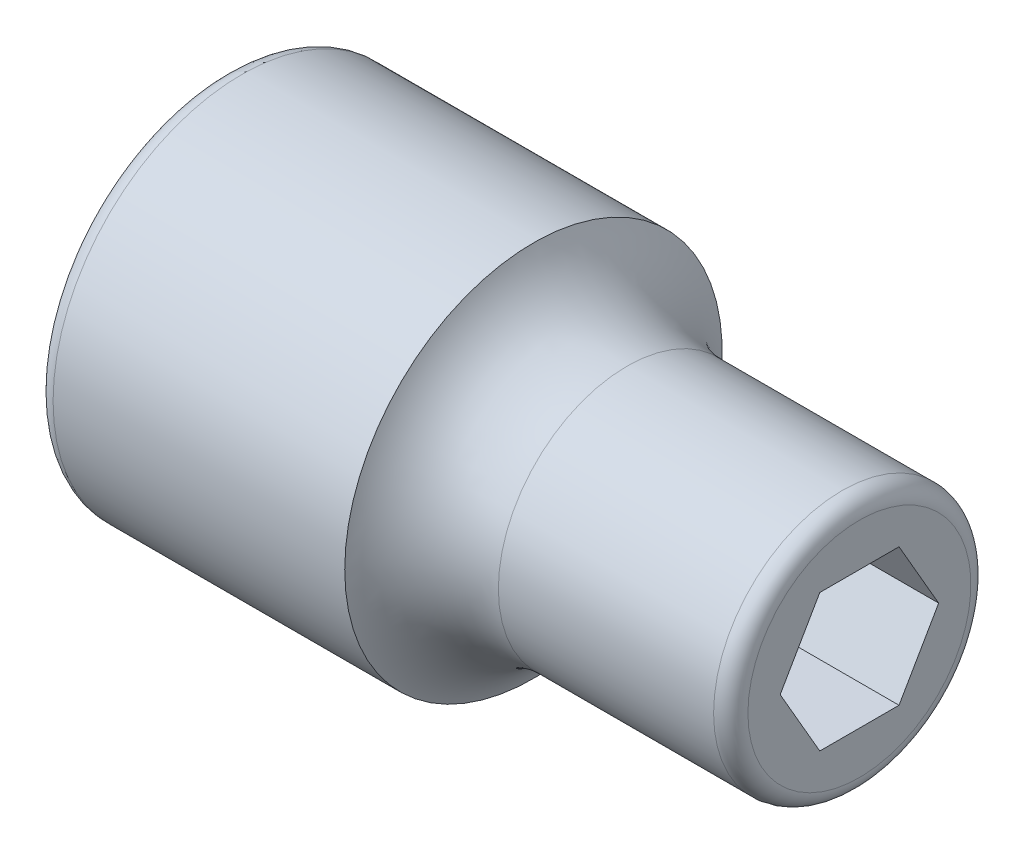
ISO-10303-21;
HEADER;
FILE_DESCRIPTION(('STEP AP214'),'2;1');
FILE_NAME('part.step','',(''),(''),'','','');
FILE_SCHEMA(('AUTOMOTIVE_DESIGN { 1 0 10303 214 1 1 1 1 }'));
ENDSEC;
DATA;
#1=APPLICATION_CONTEXT('core data for automotive mechanical design processes');
#2=APPLICATION_PROTOCOL_DEFINITION('international standard','automotive_design',2000,#1);
#3=PRODUCT_CONTEXT('',#1,'mechanical');
#4=PRODUCT('Part','Part','',(#3));
#5=PRODUCT_RELATED_PRODUCT_CATEGORY('part','',(#4));
#6=PRODUCT_DEFINITION_FORMATION('','',#4);
#7=PRODUCT_DEFINITION_CONTEXT('part definition',#1,'design');
#8=PRODUCT_DEFINITION('design','',#6,#7);
#9=PRODUCT_DEFINITION_SHAPE('','',#8);
#10=(LENGTH_UNIT() NAMED_UNIT(*) SI_UNIT(.MILLI.,.METRE.));
#11=(NAMED_UNIT(*) PLANE_ANGLE_UNIT() SI_UNIT($,.RADIAN.));
#12=(NAMED_UNIT(*) SI_UNIT($,.STERADIAN.) SOLID_ANGLE_UNIT());
#13=UNCERTAINTY_MEASURE_WITH_UNIT(LENGTH_MEASURE(1.E-05),#10,'distance_accuracy_value','');
#14=(GEOMETRIC_REPRESENTATION_CONTEXT(3) GLOBAL_UNCERTAINTY_ASSIGNED_CONTEXT((#13)) GLOBAL_UNIT_ASSIGNED_CONTEXT((#10,
#11,#12)) REPRESENTATION_CONTEXT('',''));
#15=CARTESIAN_POINT('',(0.,0.,0.));
#16=DIRECTION('',(0.,0.,1.));
#17=DIRECTION('',(1.,0.,0.));
#18=AXIS2_PLACEMENT_3D('',#15,#16,#17);
#19=CARTESIAN_POINT('',(-10.,0.,0.));
#20=DIRECTION('',(-1.,0.,0.));
#21=DIRECTION('',(0.,0.,1.));
#22=AXIS2_PLACEMENT_3D('',#19,#20,#21);
#23=CONICAL_SURFACE('',#22,6.5,1.29249666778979);
#24=CARTESIAN_POINT('',(-9.00000000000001,0.,0.));
#25=DIRECTION('',(-1.,0.,0.));
#26=DIRECTION('',(0.,0.,1.));
#27=AXIS2_PLACEMENT_3D('',#24,#25,#26);
#28=CIRCLE('',#27,3.);
#29=CARTESIAN_POINT('',(-9.00000000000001,0.,3.));
#30=VERTEX_POINT('',#29);
#31=EDGE_CURVE('E277',#30,#30,#28,.T.);
#32=ORIENTED_EDGE('',*,*,#31,.F.);
#33=EDGE_LOOP('',(#32));
#34=FACE_BOUND('',#33,.T.);
#35=CARTESIAN_POINT('',(-10.,0.,0.));
#36=DIRECTION('',(-1.,0.,0.));
#37=DIRECTION('',(0.,0.,1.));
#38=AXIS2_PLACEMENT_3D('',#35,#36,#37);
#39=CIRCLE('',#38,6.5);
#40=CARTESIAN_POINT('',(-9.99999999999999,0.,6.50000000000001));
#41=VERTEX_POINT('',#40);
#42=CARTESIAN_POINT('',(-10.,6.5,0.));
#43=VERTEX_POINT('',#42);
#44=EDGE_CURVE('E281',#41,#43,#39,.T.);
#45=ORIENTED_EDGE('',*,*,#44,.T.);
#46=CARTESIAN_POINT('',(-10.,0.,-6.5));
#47=VERTEX_POINT('',#46);
#48=EDGE_CURVE('E285',#43,#47,#39,.T.);
#49=ORIENTED_EDGE('',*,*,#48,.T.);
#50=CARTESIAN_POINT('',(-9.99999999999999,-6.5,0.));
#51=VERTEX_POINT('',#50);
#52=EDGE_CURVE('E409',#47,#51,#39,.T.);
#53=ORIENTED_EDGE('',*,*,#52,.T.);
#54=EDGE_CURVE('E280',#51,#41,#39,.T.);
#55=ORIENTED_EDGE('',*,*,#54,.T.);
#56=EDGE_LOOP('',(#45,#49,#53,#55));
#57=FACE_BOUND('',#56,.T.);
#58=ADVANCED_FACE('F30',(#34,#57),#23,.F.);
#59=CARTESIAN_POINT('',(0.,0.,0.));
#60=DIRECTION('',(-1.,0.,0.));
#61=DIRECTION('',(0.,0.,1.));
#62=AXIS2_PLACEMENT_3D('',#59,#60,#61);
#63=CYLINDRICAL_SURFACE('',#62,3.);
#64=CARTESIAN_POINT('',(0.,0.,0.));
#65=DIRECTION('',(-1.,0.,0.));
#66=DIRECTION('',(0.,0.,1.));
#67=AXIS2_PLACEMENT_3D('',#64,#65,#66);
#68=CIRCLE('',#67,3.);
#69=CARTESIAN_POINT('',(0.,0.,3.));
#70=VERTEX_POINT('',#69);
#71=EDGE_CURVE('E274',#70,#70,#68,.T.);
#72=ORIENTED_EDGE('',*,*,#71,.F.);
#73=EDGE_LOOP('',(#72));
#74=FACE_BOUND('',#73,.T.);
#75=ORIENTED_EDGE('',*,*,#31,.T.);
#76=EDGE_LOOP('',(#75));
#77=FACE_BOUND('',#76,.T.);
#78=ADVANCED_FACE('F326',(#74,#77),#63,.F.);
#79=CARTESIAN_POINT('',(0.,3.,0.));
#80=DIRECTION('',(-1.,0.,0.));
#81=DIRECTION('',(0.,0.,1.));
#82=AXIS2_PLACEMENT_3D('',#79,#80,#81);
#83=PLANE('',#82);
#84=ORIENTED_EDGE('',*,*,#71,.T.);
#85=EDGE_LOOP('',(#84));
#86=FACE_BOUND('',#85,.T.);
#87=DIRECTION('',(0.,-0.866025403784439,0.5));
#88=VECTOR('',#87,1.);
#89=CARTESIAN_POINT('',(0.,4.00000000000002,2.30940107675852));
#90=LINE('',#89,#88);
#91=CARTESIAN_POINT('',(0.,4.00000000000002,2.30940107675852));
#92=VERTEX_POINT('',#91);
#93=CARTESIAN_POINT('',(0.,0.,4.61880215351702));
#94=VERTEX_POINT('',#93);
#95=EDGE_CURVE('E182',#92,#94,#90,.T.);
#96=ORIENTED_EDGE('',*,*,#95,.T.);
#97=DIRECTION('',(0.,-0.866025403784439,-0.5));
#98=VECTOR('',#97,1.);
#99=CARTESIAN_POINT('',(0.,0.,4.61880215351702));
#100=LINE('',#99,#98);
#101=CARTESIAN_POINT('',(0.,-4.00000000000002,2.3094010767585));
#102=VERTEX_POINT('',#101);
#103=EDGE_CURVE('E185',#94,#102,#100,.T.);
#104=ORIENTED_EDGE('',*,*,#103,.T.);
#105=DIRECTION('',(0.,0.,-1.));
#106=VECTOR('',#105,1.);
#107=CARTESIAN_POINT('',(0.,-4.00000000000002,2.3094010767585));
#108=LINE('',#107,#106);
#109=CARTESIAN_POINT('',(0.,-4.,-2.30940107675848));
#110=VERTEX_POINT('',#109);
#111=EDGE_CURVE('E155',#102,#110,#108,.T.);
#112=ORIENTED_EDGE('',*,*,#111,.T.);
#113=DIRECTION('',(0.,0.866025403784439,-0.5));
#114=VECTOR('',#113,1.);
#115=CARTESIAN_POINT('',(0.,-4.,-2.30940107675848));
#116=LINE('',#115,#114);
#117=CARTESIAN_POINT('',(0.,0.,-4.61880215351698));
#118=VERTEX_POINT('',#117);
#119=EDGE_CURVE('E188',#110,#118,#116,.T.);
#120=ORIENTED_EDGE('',*,*,#119,.T.);
#121=DIRECTION('',(0.,0.866025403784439,0.5));
#122=VECTOR('',#121,1.);
#123=CARTESIAN_POINT('',(0.,0.,-4.61880215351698));
#124=LINE('',#123,#122);
#125=CARTESIAN_POINT('',(0.,4.,-2.30940107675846));
#126=VERTEX_POINT('',#125);
#127=EDGE_CURVE('E191',#118,#126,#124,.T.);
#128=ORIENTED_EDGE('',*,*,#127,.T.);
#129=DIRECTION('',(0.,0.,1.));
#130=VECTOR('',#129,1.);
#131=CARTESIAN_POINT('',(0.,4.,-2.30940107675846));
#132=LINE('',#131,#130);
#133=EDGE_CURVE('E194',#126,#92,#132,.T.);
#134=ORIENTED_EDGE('',*,*,#133,.T.);
#135=EDGE_LOOP('',(#96,#104,#112,#120,#128,#134));
#136=FACE_BOUND('',#135,.T.);
#137=ADVANCED_FACE('F331',(#86,#136),#83,.F.);
#138=CARTESIAN_POINT('',(8.99999999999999,6.50000000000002,0.));
#139=DIRECTION('',(-1.,0.,0.));
#140=DIRECTION('',(0.,0.,1.));
#141=AXIS2_PLACEMENT_3D('',#138,#139,#140);
#142=PLANE('',#141);
#143=DIRECTION('',(0.,-0.866025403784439,-0.5));
#144=VECTOR('',#143,1.);
#145=CARTESIAN_POINT('',(9.00000000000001,0.,4.61880215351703));
#146=LINE('',#145,#144);
#147=CARTESIAN_POINT('',(9.00000000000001,0.,4.61880215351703));
#148=VERTEX_POINT('',#147);
#149=CARTESIAN_POINT('',(9.00000000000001,-4.00000000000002,2.30940107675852));
#150=VERTEX_POINT('',#149);
#151=EDGE_CURVE('E163',#148,#150,#146,.T.);
#152=ORIENTED_EDGE('',*,*,#151,.F.);
#153=DIRECTION('',(0.,-0.866025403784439,0.5));
#154=VECTOR('',#153,1.);
#155=CARTESIAN_POINT('',(9.00000000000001,4.00000000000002,2.30940107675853));
#156=LINE('',#155,#154);
#157=CARTESIAN_POINT('',(9.00000000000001,4.00000000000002,2.30940107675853));
#158=VERTEX_POINT('',#157);
#159=EDGE_CURVE('E49',#158,#148,#156,.T.);
#160=ORIENTED_EDGE('',*,*,#159,.F.);
#161=DIRECTION('',(0.,0.,1.));
#162=VECTOR('',#161,1.);
#163=CARTESIAN_POINT('',(8.99999999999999,4.,-2.30940107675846));
#164=LINE('',#163,#162);
#165=CARTESIAN_POINT('',(8.99999999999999,4.,-2.30940107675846));
#166=VERTEX_POINT('',#165);
#167=EDGE_CURVE('E179',#166,#158,#164,.T.);
#168=ORIENTED_EDGE('',*,*,#167,.F.);
#169=DIRECTION('',(0.,0.866025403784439,0.5));
#170=VECTOR('',#169,1.);
#171=CARTESIAN_POINT('',(8.99999999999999,0.,-4.61880215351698));
#172=LINE('',#171,#170);
#173=CARTESIAN_POINT('',(8.99999999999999,0.,-4.61880215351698));
#174=VERTEX_POINT('',#173);
#175=EDGE_CURVE('E173',#174,#166,#172,.T.);
#176=ORIENTED_EDGE('',*,*,#175,.F.);
#177=DIRECTION('',(0.,0.866025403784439,-0.5));
#178=VECTOR('',#177,1.);
#179=CARTESIAN_POINT('',(9.00000000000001,-4.,-2.30940107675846));
#180=LINE('',#179,#178);
#181=CARTESIAN_POINT('',(9.00000000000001,-4.,-2.30940107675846));
#182=VERTEX_POINT('',#181);
#183=EDGE_CURVE('E171',#182,#174,#180,.T.);
#184=ORIENTED_EDGE('',*,*,#183,.F.);
#185=DIRECTION('',(0.,0.,-1.));
#186=VECTOR('',#185,1.);
#187=CARTESIAN_POINT('',(9.00000000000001,-4.00000000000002,2.30940107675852));
#188=LINE('',#187,#186);
#189=EDGE_CURVE('E152',#150,#182,#188,.T.);
#190=ORIENTED_EDGE('',*,*,#189,.F.);
#191=EDGE_LOOP('',(#152,#160,#168,#176,#184,#190));
#192=FACE_BOUND('',#191,.T.);
#193=CARTESIAN_POINT('',(9.00000000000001,0.,0.));
#194=DIRECTION('',(-1.,0.,0.));
#195=DIRECTION('',(0.,0.,1.));
#196=AXIS2_PLACEMENT_3D('',#193,#194,#195);
#197=CIRCLE('',#196,6.5);
#198=CARTESIAN_POINT('',(9.00000000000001,0.,6.5));
#199=VERTEX_POINT('',#198);
#200=EDGE_CURVE('E271',#199,#199,#197,.T.);
#201=ORIENTED_EDGE('',*,*,#200,.F.);
#202=EDGE_LOOP('',(#201));
#203=FACE_BOUND('',#202,.T.);
#204=ADVANCED_FACE('F167',(#192,#203),#142,.F.);
#205=CARTESIAN_POINT('',(8.00000000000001,0.,0.));
#206=DIRECTION('',(-1.,0.,0.));
#207=DIRECTION('',(0.,0.,1.));
#208=AXIS2_PLACEMENT_3D('',#205,#206,#207);
#209=TOROIDAL_SURFACE('',#208,6.5,1.);
#210=CARTESIAN_POINT('',(8.00000000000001,0.,0.));
#211=DIRECTION('',(-1.,0.,0.));
#212=DIRECTION('',(0.,0.,1.));
#213=AXIS2_PLACEMENT_3D('',#210,#211,#212);
#214=CIRCLE('',#213,7.5);
#215=CARTESIAN_POINT('',(8.00000000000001,0.,7.50000000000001));
#216=VERTEX_POINT('',#215);
#217=EDGE_CURVE('E268',#216,#216,#214,.T.);
#218=ORIENTED_EDGE('',*,*,#217,.F.);
#219=EDGE_LOOP('',(#218));
#220=FACE_BOUND('',#219,.T.);
#221=ORIENTED_EDGE('',*,*,#200,.T.);
#222=EDGE_LOOP('',(#221));
#223=FACE_BOUND('',#222,.T.);
#224=ADVANCED_FACE('F448',(#220,#223),#209,.T.);
#225=CARTESIAN_POINT('',(0.,0.,0.));
#226=DIRECTION('',(-1.,0.,0.));
#227=DIRECTION('',(0.,0.,1.));
#228=AXIS2_PLACEMENT_3D('',#225,#226,#227);
#229=CYLINDRICAL_SURFACE('',#228,7.5);
#230=CARTESIAN_POINT('',(-4.54564394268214,0.,0.));
#231=DIRECTION('',(-1.,0.,0.));
#232=DIRECTION('',(0.,0.,1.));
#233=AXIS2_PLACEMENT_3D('',#230,#231,#232);
#234=CIRCLE('',#233,7.5);
#235=CARTESIAN_POINT('',(-4.54564394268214,0.,7.50000000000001));
#236=VERTEX_POINT('',#235);
#237=EDGE_CURVE('E265',#236,#236,#234,.T.);
#238=ORIENTED_EDGE('',*,*,#237,.F.);
#239=EDGE_LOOP('',(#238));
#240=FACE_BOUND('',#239,.T.);
#241=ORIENTED_EDGE('',*,*,#217,.T.);
#242=EDGE_LOOP('',(#241));
#243=FACE_BOUND('',#242,.T.);
#244=ADVANCED_FACE('F444',(#240,#243),#229,.T.);
#245=CARTESIAN_POINT('',(-4.54564394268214,0.,0.));
#246=DIRECTION('',(-1.,0.,0.));
#247=DIRECTION('',(0.,0.,1.));
#248=AXIS2_PLACEMENT_3D('',#245,#246,#247);
#249=TOROIDAL_SURFACE('',#248,13.5,6.);
#250=CARTESIAN_POINT('',(-9.99999999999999,0.,0.));
#251=DIRECTION('',(-1.,0.,0.));
#252=DIRECTION('',(0.,0.,1.));
#253=AXIS2_PLACEMENT_3D('',#250,#251,#252);
#254=CIRCLE('',#253,11.);
#255=CARTESIAN_POINT('',(-9.99999999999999,0.,11.));
#256=VERTEX_POINT('',#255);
#257=EDGE_CURVE('E262',#256,#256,#254,.T.);
#258=ORIENTED_EDGE('',*,*,#257,.F.);
#259=EDGE_LOOP('',(#258));
#260=FACE_BOUND('',#259,.T.);
#261=ORIENTED_EDGE('',*,*,#237,.T.);
#262=EDGE_LOOP('',(#261));
#263=FACE_BOUND('',#262,.T.);
#264=ADVANCED_FACE('F440',(#260,#263),#249,.F.);
#265=CARTESIAN_POINT('',(0.,0.,0.));
#266=DIRECTION('',(-1.,0.,0.));
#267=DIRECTION('',(0.,0.,1.));
#268=AXIS2_PLACEMENT_3D('',#265,#266,#267);
#269=CYLINDRICAL_SURFACE('',#268,11.);
#270=CARTESIAN_POINT('',(-27.,0.,0.));
#271=DIRECTION('',(-1.,0.,0.));
#272=DIRECTION('',(0.,0.,1.));
#273=AXIS2_PLACEMENT_3D('',#270,#271,#272);
#274=CIRCLE('',#273,11.);
#275=CARTESIAN_POINT('',(-27.,0.,11.));
#276=VERTEX_POINT('',#275);
#277=EDGE_CURVE('E259',#276,#276,#274,.T.);
#278=ORIENTED_EDGE('',*,*,#277,.F.);
#279=EDGE_LOOP('',(#278));
#280=FACE_BOUND('',#279,.T.);
#281=ORIENTED_EDGE('',*,*,#257,.T.);
#282=EDGE_LOOP('',(#281));
#283=FACE_BOUND('',#282,.T.);
#284=ADVANCED_FACE('F432',(#280,#283),#269,.T.);
#285=CARTESIAN_POINT('',(-27.,0.,0.));
#286=DIRECTION('',(-1.,0.,0.));
#287=DIRECTION('',(0.,0.,1.));
#288=AXIS2_PLACEMENT_3D('',#285,#286,#287);
#289=TOROIDAL_SURFACE('',#288,10.,1.);
#290=CARTESIAN_POINT('',(-28.,0.,0.));
#291=DIRECTION('',(-1.,0.,0.));
#292=DIRECTION('',(0.,0.,1.));
#293=AXIS2_PLACEMENT_3D('',#290,#291,#292);
#294=CIRCLE('',#293,10.);
#295=CARTESIAN_POINT('',(-28.,0.,10.));
#296=VERTEX_POINT('',#295);
#297=EDGE_CURVE('E256',#296,#296,#294,.T.);
#298=ORIENTED_EDGE('',*,*,#297,.F.);
#299=EDGE_LOOP('',(#298));
#300=FACE_BOUND('',#299,.T.);
#301=ORIENTED_EDGE('',*,*,#277,.T.);
#302=EDGE_LOOP('',(#301));
#303=FACE_BOUND('',#302,.T.);
#304=ADVANCED_FACE('F427',(#300,#303),#289,.T.);
#305=CARTESIAN_POINT('',(-28.,8.99999999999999,0.));
#306=DIRECTION('',(1.,0.,0.));
#307=DIRECTION('',(0.,0.,-1.));
#308=AXIS2_PLACEMENT_3D('',#305,#306,#307);
#309=PLANE('',#308);
#310=CARTESIAN_POINT('',(-28.,0.,0.));
#311=DIRECTION('',(-1.,0.,0.));
#312=DIRECTION('',(0.,0.,1.));
#313=AXIS2_PLACEMENT_3D('',#310,#311,#312);
#314=CIRCLE('',#313,9.);
#315=CARTESIAN_POINT('',(-28.,0.,9.00000000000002));
#316=VERTEX_POINT('',#315);
#317=EDGE_CURVE('E234',#316,#316,#314,.T.);
#318=ORIENTED_EDGE('',*,*,#317,.F.);
#319=EDGE_LOOP('',(#318));
#320=FACE_BOUND('',#319,.T.);
#321=ORIENTED_EDGE('',*,*,#297,.T.);
#322=EDGE_LOOP('',(#321));
#323=FACE_BOUND('',#322,.T.);
#324=ADVANCED_FACE('F423',(#320,#323),#309,.F.);
#325=CARTESIAN_POINT('',(-28.,0.,0.));
#326=DIRECTION('',(-1.,0.,0.));
#327=DIRECTION('',(0.,0.,1.));
#328=AXIS2_PLACEMENT_3D('',#325,#326,#327);
#329=CONICAL_SURFACE('',#328,9.,1.0471975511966);
#330=CARTESIAN_POINT('',(-30.5576145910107,6.50000000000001,-11.7521363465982));
#331=CARTESIAN_POINT('',(-30.4054892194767,6.5,-11.4509730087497));
#332=CARTESIAN_POINT('',(-30.254408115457,6.5,-11.1492757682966));
#333=CARTESIAN_POINT('',(-29.954900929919,6.5,-10.5445340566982));
#334=CARTESIAN_POINT('',(-29.8064750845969,6.5,-10.2414894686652));
#335=CARTESIAN_POINT('',(-29.5124023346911,6.5,-9.63285472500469));
#336=CARTESIAN_POINT('',(-29.3667658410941,6.5,-9.32725952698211));
#337=CARTESIAN_POINT('',(-29.0795802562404,6.5,-8.71416153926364));
#338=CARTESIAN_POINT('',(-28.938031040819,6.5,-8.40665880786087));
#339=CARTESIAN_POINT('',(-28.6532723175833,6.5,-7.77421539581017));
#340=CARTESIAN_POINT('',(-28.510320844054,6.5,-7.44915808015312));
#341=CARTESIAN_POINT('',(-28.2317222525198,6.5,-6.79588008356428));
#342=CARTESIAN_POINT('',(-28.0960757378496,6.5,-6.46765914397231));
#343=CARTESIAN_POINT('',(-27.8345137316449,6.5,-5.80778142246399));
#344=CARTESIAN_POINT('',(-27.7085870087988,6.5,-5.47612912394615));
#345=CARTESIAN_POINT('',(-27.4693743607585,6.5,-4.80832449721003));
#346=CARTESIAN_POINT('',(-27.356085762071,6.5,-4.4721731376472));
#347=CARTESIAN_POINT('',(-27.147157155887,6.5,-3.7977916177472));
#348=CARTESIAN_POINT('',(-27.0513628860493,6.5,-3.45960982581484));
#349=CARTESIAN_POINT('',(-26.8810976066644,6.5,-2.77778978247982));
#350=CARTESIAN_POINT('',(-26.8066248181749,6.5,-2.4341519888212));
#351=CARTESIAN_POINT('',(-26.7154889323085,6.5,-1.91809179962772));
#352=CARTESIAN_POINT('',(-26.6886838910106,6.5,-1.74743857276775));
#353=CARTESIAN_POINT('',(-26.6421154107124,6.5,-1.40518144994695));
#354=CARTESIAN_POINT('',(-26.6223511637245,6.5,-1.23357766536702));
#355=CARTESIAN_POINT('',(-26.5903457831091,6.5,-0.889664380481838));
#356=CARTESIAN_POINT('',(-26.5781046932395,6.5,-0.717354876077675));
#357=CARTESIAN_POINT('',(-26.5614672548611,6.5,-0.372371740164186));
#358=CARTESIAN_POINT('',(-26.5570701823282,6.5,-0.199698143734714));
#359=CARTESIAN_POINT('',(-26.5561881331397,6.5,0.168707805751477));
#360=CARTESIAN_POINT('',(-26.5608366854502,6.5,0.364443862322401));
#361=CARTESIAN_POINT('',(-26.5802084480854,6.5,0.755415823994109));
#362=CARTESIAN_POINT('',(-26.5949320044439,6.5,0.950651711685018));
#363=CARTESIAN_POINT('',(-26.6339613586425,6.5,1.34019669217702));
#364=CARTESIAN_POINT('',(-26.6582692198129,6.5,1.53450557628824));
#365=CARTESIAN_POINT('',(-26.715722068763,6.5,1.92180270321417));
#366=CARTESIAN_POINT('',(-26.7488671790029,6.5,2.11479092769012));
#367=CARTESIAN_POINT('',(-26.8239967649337,6.5,2.50384101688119));
#368=CARTESIAN_POINT('',(-26.8661745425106,6.5,2.69986527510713));
#369=CARTESIAN_POINT('',(-26.9578591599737,6.5,3.09018285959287));
#370=CARTESIAN_POINT('',(-27.0073661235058,6.5,3.28447615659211));
#371=CARTESIAN_POINT('',(-27.1127397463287,6.5,3.67134216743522));
#372=CARTESIAN_POINT('',(-27.1686070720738,6.5,3.86391469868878));
#373=CARTESIAN_POINT('',(-27.285799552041,6.5,4.24736827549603));
#374=CARTESIAN_POINT('',(-27.3471243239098,6.5,4.43824943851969));
#375=CARTESIAN_POINT('',(-27.4835833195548,6.5,4.84573547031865));
#376=CARTESIAN_POINT('',(-27.5594361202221,6.5,5.06209899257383));
#377=CARTESIAN_POINT('',(-27.7162410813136,6.5,5.49297706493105));
#378=CARTESIAN_POINT('',(-27.7971935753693,6.5,5.70749149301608));
#379=CARTESIAN_POINT('',(-27.9633781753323,6.5,6.13491998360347));
#380=CARTESIAN_POINT('',(-28.0486114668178,6.5,6.34783358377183));
#381=CARTESIAN_POINT('',(-28.2226540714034,6.5,6.7721969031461));
#382=CARTESIAN_POINT('',(-28.3114634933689,6.5,6.98364657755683));
#383=CARTESIAN_POINT('',(-28.5825817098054,6.5,7.61654060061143));
#384=CARTESIAN_POINT('',(-28.7693932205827,6.5,8.03605612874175));
#385=CARTESIAN_POINT('',(-29.151582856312,6.5,8.87106252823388));
#386=CARTESIAN_POINT('',(-29.3469597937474,6.5,9.28655394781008));
#387=CARTESIAN_POINT('',(-29.7448752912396,6.5,10.1161801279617));
#388=CARTESIAN_POINT('',(-29.9474399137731,6.5,10.5303023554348));
#389=CARTESIAN_POINT('',(-30.3573898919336,6.5,11.3561615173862));
#390=CARTESIAN_POINT('',(-30.5647753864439,6.5,11.7678983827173));
#391=CARTESIAN_POINT('',(-30.9831095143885,6.5,12.5892144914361));
#392=CARTESIAN_POINT('',(-31.1940557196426,6.5,12.9987949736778));
#393=CARTESIAN_POINT('',(-31.6188428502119,6.5,13.8164446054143));
#394=CARTESIAN_POINT('',(-31.8326837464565,6.5,14.2245137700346));
#395=CARTESIAN_POINT('',(-32.4167228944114,6.5,15.3314433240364));
#396=CARTESIAN_POINT('',(-32.7891517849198,6.5,16.0291261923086));
#397=CARTESIAN_POINT('',(-33.5387742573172,6.5,17.4220905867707));
#398=CARTESIAN_POINT('',(-33.9159687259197,6.5,18.1173716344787));
#399=CARTESIAN_POINT('',(-34.6708699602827,6.5,19.5007505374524));
#400=CARTESIAN_POINT('',(-35.0485506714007,6.5,20.1888626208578));
#401=CARTESIAN_POINT('',(-35.6169204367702,6.5,21.2199167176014));
#402=CARTESIAN_POINT('',(-35.8066652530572,6.5,21.563379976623));
#403=CARTESIAN_POINT('',(-36.1867090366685,6.5,22.2499991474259));
#404=CARTESIAN_POINT('',(-36.3770080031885,6.49999999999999,22.5931550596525));
#405=CARTESIAN_POINT('',(-36.5675468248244,6.49999999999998,22.9361777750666));
#406=B_SPLINE_CURVE_WITH_KNOTS('',3,(#330,#331,#332,#333,#334,#335,#336,#337,#338,#339,#340,
#341,#342,#343,#344,#345,#346,#347,#348,#349,#350,#351,#352,#353,#354,#355,#356,#357,#358,#359,
#360,#361,#362,#363,#364,#365,#366,#367,#368,#369,#370,#371,#372,#373,#374,#375,#376,#377,#378,
#379,#380,#381,#382,#383,#384,#385,#386,#387,#388,#389,#390,#391,#392,#393,#394,#395,#396,#397,
#398,#399,#400,#401,#402,#403,#404,#405),.UNSPECIFIED.,.F.,.F.,(4,2,2,2,2,2,2,2,2,2,2,2,2,2,2,2,
2,2,2,2,2,2,2,2,2,2,2,2,2,2,2,2,2,2,2,2,2,4),(0.,1.01221862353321,2.02452684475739,
3.04007404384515,4.05559035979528,5.12082778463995,6.18615305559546,7.25022830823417,
8.31407803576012,9.36803883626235,10.4219116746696,10.9400261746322,11.4580811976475,
11.9761392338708,12.4941494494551,13.081251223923,13.6683731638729,14.2556215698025,
14.8428781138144,15.4442489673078,16.0456299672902,16.647074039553,17.2484760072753,
17.9362210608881,18.6240111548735,19.3119927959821,19.9999953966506,21.3775283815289,
22.7548709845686,24.1378567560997,25.5208824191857,26.9030002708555,28.2851042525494,
30.6576645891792,33.0306730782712,35.3855049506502,36.5626753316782,37.739844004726),.UNSPECIFIED.);
#407=CARTESIAN_POINT('',(-27.7198079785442,6.5,-5.49999999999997));
#408=VERTEX_POINT('',#407);
#409=CARTESIAN_POINT('',(-27.7198079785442,6.49999999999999,5.50000000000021));
#410=VERTEX_POINT('',#409);
#411=EDGE_CURVE('E284',#408,#410,#406,.T.);
#412=ORIENTED_EDGE('',*,*,#411,.T.);
#413=CARTESIAN_POINT('',(-27.7197333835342,6.49999998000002,5.49980000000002));
#414=CARTESIAN_POINT('',(-27.7293540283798,6.50000453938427,5.52559205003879));
#415=CARTESIAN_POINT('',(-27.7386202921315,6.49901163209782,5.55150730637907));
#416=CARTESIAN_POINT('',(-27.7563875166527,6.4949761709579,5.60345282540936));
#417=CARTESIAN_POINT('',(-27.7648881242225,6.49193267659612,5.6294831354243));
#418=CARTESIAN_POINT('',(-27.7891719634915,6.47963121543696,5.70760426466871));
#419=CARTESIAN_POINT('',(-27.8037032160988,6.46720186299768,5.75963429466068));
#420=CARTESIAN_POINT('',(-27.8289071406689,6.43373424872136,5.86201024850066));
#421=CARTESIAN_POINT('',(-27.8395680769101,6.41267020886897,5.91235063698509));
#422=CARTESIAN_POINT('',(-27.856523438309,6.36224712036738,6.0094240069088));
#423=CARTESIAN_POINT('',(-27.8628245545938,6.33290088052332,6.05616241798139));
#424=CARTESIAN_POINT('',(-27.8705536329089,6.26868988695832,6.14171819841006));
#425=CARTESIAN_POINT('',(-27.8722542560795,6.23426840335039,6.18084420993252));
#426=CARTESIAN_POINT('',(-27.8715013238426,6.159785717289,6.25324543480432));
#427=CARTESIAN_POINT('',(-27.8690484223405,6.11972540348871,6.28652156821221));
#428=CARTESIAN_POINT('',(-27.8602479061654,6.03670997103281,6.34524445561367));
#429=CARTESIAN_POINT('',(-27.8540381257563,5.99390316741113,6.37092246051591));
#430=CARTESIAN_POINT('',(-27.8380723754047,5.90545961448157,6.4154556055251));
#431=CARTESIAN_POINT('',(-27.8283126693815,5.8598199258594,6.43430351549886));
#432=CARTESIAN_POINT('',(-27.8043232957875,5.76191763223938,6.4666094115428));
#433=CARTESIAN_POINT('',(-27.7897222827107,5.70947548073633,6.47925566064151));
#434=CARTESIAN_POINT('',(-27.7652799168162,5.63069503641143,6.49178075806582));
#435=CARTESIAN_POINT('',(-27.7567107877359,5.60442017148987,6.49488176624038));
#436=CARTESIAN_POINT('',(-27.7387923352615,5.55198874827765,6.49899291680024));
#437=CARTESIAN_POINT('',(-27.7294434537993,5.52583213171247,6.50000423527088));
#438=CARTESIAN_POINT('',(-27.7197333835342,5.49980000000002,6.49999998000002));
#439=B_SPLINE_CURVE_WITH_KNOTS('',3,(#413,#414,#415,#416,#417,#418,#419,#420,#421,#422,#423,
#424,#425,#426,#427,#428,#429,#430,#431,#432,#433,#434,#435,#436,#437,#438),.UNSPECIFIED.,.F.,
.F.,(4,2,2,2,2,2,2,2,2,2,2,2,4),(0.,0.0825432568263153,0.165124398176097,0.330574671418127,
0.49652251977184,0.662215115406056,0.817847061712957,0.973454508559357,1.12367255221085,
1.27404915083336,1.44082159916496,1.52417731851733,1.60748611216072),.UNSPECIFIED.);
#440=CARTESIAN_POINT('',(-27.7198079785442,5.49999999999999,6.50000000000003));
#441=VERTEX_POINT('',#440);
#442=EDGE_CURVE('E11',#410,#441,#439,.T.);
#443=ORIENTED_EDGE('',*,*,#442,.T.);
#444=CARTESIAN_POINT('',(-30.5576153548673,-11.7521378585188,6.50000000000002));
#445=CARTESIAN_POINT('',(-30.405489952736,-11.4509744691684,6.50000000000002));
#446=CARTESIAN_POINT('',(-30.2544088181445,-11.1492771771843,6.50000000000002));
#447=CARTESIAN_POINT('',(-29.9549015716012,-10.5445353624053,6.50000000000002));
#448=CARTESIAN_POINT('',(-29.8064756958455,-10.2414907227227,6.50000000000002));
#449=CARTESIAN_POINT('',(-29.5124028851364,-9.63285587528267,6.50000000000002));
#450=CARTESIAN_POINT('',(-29.3667663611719,-9.32726062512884,6.50000000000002));
#451=CARTESIAN_POINT('',(-29.079580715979,-8.71416253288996,6.50000000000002));
#452=CARTESIAN_POINT('',(-28.938031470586,-8.40665974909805,6.50000000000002));
#453=CARTESIAN_POINT('',(-28.6532726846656,-7.77421622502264,6.50000000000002));
#454=CARTESIAN_POINT('',(-28.5103211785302,-7.44915884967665,6.50000000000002));
#455=CARTESIAN_POINT('',(-28.2317225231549,-6.79588073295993,6.50000000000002));
#456=CARTESIAN_POINT('',(-28.0960759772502,-6.46765973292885,6.50000000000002));
#457=CARTESIAN_POINT('',(-27.8345139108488,-5.80778188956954,6.50000000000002));
#458=CARTESIAN_POINT('',(-27.708587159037,-5.47612952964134,6.50000000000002));
#459=CARTESIAN_POINT('',(-27.4693744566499,-4.80832477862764,6.50000000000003));
#460=CARTESIAN_POINT('',(-27.3560858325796,-4.4721733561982,6.50000000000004));
#461=CARTESIAN_POINT('',(-27.1471571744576,-3.79779168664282,6.50000000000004));
#462=CARTESIAN_POINT('',(-27.0513628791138,-3.45960980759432,6.50000000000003));
#463=CARTESIAN_POINT('',(-26.8810975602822,-2.77778958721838,6.50000000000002));
#464=CARTESIAN_POINT('',(-26.8066247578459,-2.43415170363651,6.50000000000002));
#465=CARTESIAN_POINT('',(-26.7154888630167,-1.91809137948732,6.50000000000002));
#466=CARTESIAN_POINT('',(-26.6886838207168,-1.74743810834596,6.50000000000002));
#467=CARTESIAN_POINT('',(-26.6421153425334,-1.40518089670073,6.50000000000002));
#468=CARTESIAN_POINT('',(-26.6223510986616,-1.23357706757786,6.50000000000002));
#469=CARTESIAN_POINT('',(-26.5903457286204,-0.889663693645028,6.50000000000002));
#470=CARTESIAN_POINT('',(-26.5781046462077,-0.717354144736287,6.50000000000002));
#471=CARTESIAN_POINT('',(-26.5614672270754,-0.372370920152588,6.50000000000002));
#472=CARTESIAN_POINT('',(-26.5570701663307,-0.199697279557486,6.50000000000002));
#473=CARTESIAN_POINT('',(-26.5561881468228,0.168708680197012,6.50000000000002));
#474=CARTESIAN_POINT('',(-26.5608367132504,0.364444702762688,6.50000000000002));
#475=CARTESIAN_POINT('',(-26.5802085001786,0.755416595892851,6.50000000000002));
#476=CARTESIAN_POINT('',(-26.5949320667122,0.950652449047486,6.50000000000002));
#477=CARTESIAN_POINT('',(-26.6339614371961,1.34019736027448,6.50000000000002));
#478=CARTESIAN_POINT('',(-26.6582693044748,1.53450620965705,6.50000000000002));
#479=CARTESIAN_POINT('',(-26.7157221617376,1.92180326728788,6.50000000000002));
#480=CARTESIAN_POINT('',(-26.7488672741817,2.11479145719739,6.50000000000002));
#481=CARTESIAN_POINT('',(-26.8239968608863,2.50384147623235,6.50000000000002));
#482=CARTESIAN_POINT('',(-26.8661746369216,2.69986569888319,6.50000000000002));
#483=CARTESIAN_POINT('',(-26.9578592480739,3.09018321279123,6.50000000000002));
#484=CARTESIAN_POINT('',(-27.0073662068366,3.28447647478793,6.50000000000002));
#485=CARTESIAN_POINT('',(-27.112739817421,3.67134241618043,6.50000000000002));
#486=CARTESIAN_POINT('',(-27.1686071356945,3.86391491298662,6.50000000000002));
#487=CARTESIAN_POINT('',(-27.2857995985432,4.24736842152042,6.50000000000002));
#488=CARTESIAN_POINT('',(-27.3471243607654,4.43824955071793,6.50000000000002));
#489=CARTESIAN_POINT('',(-27.483583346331,4.84573554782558,6.50000000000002));
#490=CARTESIAN_POINT('',(-27.5594361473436,5.06209906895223,6.50000000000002));
#491=CARTESIAN_POINT('',(-27.7162411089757,5.49297713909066,6.50000000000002));
#492=CARTESIAN_POINT('',(-27.7971936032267,5.70749156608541,6.50000000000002));
#493=CARTESIAN_POINT('',(-27.9633782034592,6.13492005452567,6.50000000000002));
#494=CARTESIAN_POINT('',(-28.0486114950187,6.34783365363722,6.50000000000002));
#495=CARTESIAN_POINT('',(-28.2226540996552,6.77219697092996,6.50000000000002));
#496=CARTESIAN_POINT('',(-28.3114635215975,6.98364664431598,6.50000000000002));
#497=CARTESIAN_POINT('',(-28.58258173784,7.61654066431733,6.50000000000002));
#498=CARTESIAN_POINT('',(-28.7693932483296,8.03605619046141,6.50000000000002));
#499=CARTESIAN_POINT('',(-29.1515828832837,8.87106258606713,6.50000000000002));
#500=CARTESIAN_POINT('',(-29.3469598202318,9.28655400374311,6.50000000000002));
#501=CARTESIAN_POINT('',(-29.7448753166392,10.1161801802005,6.50000000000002));
#502=CARTESIAN_POINT('',(-29.9474399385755,10.5303024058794,6.50000000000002));
#503=CARTESIAN_POINT('',(-30.357389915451,11.3561615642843,6.50000000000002));
#504=CARTESIAN_POINT('',(-30.5647754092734,11.7678984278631,6.50000000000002));
#505=CARTESIAN_POINT('',(-30.983109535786,12.5892145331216,6.50000000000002));
#506=CARTESIAN_POINT('',(-31.1940557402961,12.9987950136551,6.50000000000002));
#507=CARTESIAN_POINT('',(-31.6188428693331,13.8164446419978,6.50000000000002));
#508=CARTESIAN_POINT('',(-31.8326837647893,14.2245138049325,6.50000000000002));
#509=CARTESIAN_POINT('',(-32.4167229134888,15.3314433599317,6.50000000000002));
#510=CARTESIAN_POINT('',(-32.7891518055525,16.0291262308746,6.50000000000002));
#511=CARTESIAN_POINT('',(-33.5387742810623,17.4220906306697,6.50000000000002));
#512=CARTESIAN_POINT('',(-33.9159687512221,18.1173716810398,6.50000000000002));
#513=CARTESIAN_POINT('',(-34.6708699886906,19.5007505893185,6.50000000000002));
#514=CARTESIAN_POINT('',(-35.0485507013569,20.1888626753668,6.50000000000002));
#515=CARTESIAN_POINT('',(-35.6169204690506,21.2199167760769,6.50000000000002));
#516=CARTESIAN_POINT('',(-35.8066652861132,21.5633800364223,6.50000000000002));
#517=CARTESIAN_POINT('',(-36.1867090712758,22.249999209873,6.50000000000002));
#518=CARTESIAN_POINT('',(-36.3770080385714,22.5931551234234,6.50000000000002));
#519=CARTESIAN_POINT('',(-36.5675468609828,22.9361778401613,6.50000000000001));
#520=B_SPLINE_CURVE_WITH_KNOTS('',3,(#444,#445,#446,#447,#448,#449,#450,#451,#452,#453,#454,
#455,#456,#457,#458,#459,#460,#461,#462,#463,#464,#465,#466,#467,#468,#469,#470,#471,#472,#473,
#474,#475,#476,#477,#478,#479,#480,#481,#482,#483,#484,#485,#486,#487,#488,#489,#490,#491,#492,
#493,#494,#495,#496,#497,#498,#499,#500,#501,#502,#503,#504,#505,#506,#507,#508,#509,#510,#511,
#512,#513,#514,#515,#516,#517,#518,#519),.UNSPECIFIED.,.F.,.F.,(4,2,2,2,2,2,2,2,2,2,2,2,2,2,2,2,
2,2,2,2,2,2,2,2,2,2,2,2,2,2,2,2,2,2,2,2,2,4),(0.,1.01221880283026,2.02452720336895,
3.04007458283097,4.05559107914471,5.1208287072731,6.18615418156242,7.25022963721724,
8.31407956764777,9.36804064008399,10.4219137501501,10.9400283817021,11.4580835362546,
11.9761417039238,12.4941520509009,13.0812537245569,13.6683755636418,14.2556238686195,
14.8428803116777,15.4442510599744,16.0456319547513,16.6470759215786,17.2484777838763,
17.9362228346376,18.6240129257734,19.3119945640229,19.9999971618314,21.377530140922,
22.7548727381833,24.1378585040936,25.520884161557,26.9030020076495,28.2851059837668,
30.657666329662,33.0306748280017,35.3855067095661,36.5626770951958,37.7398457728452),.UNSPECIFIED.);
#521=CARTESIAN_POINT('',(-27.7198079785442,-5.49999999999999,6.50000000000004));
#522=VERTEX_POINT('',#521);
#523=EDGE_CURVE('E42',#441,#522,#520,.F.);
#524=ORIENTED_EDGE('',*,*,#523,.T.);
#525=CARTESIAN_POINT('',(-27.7197333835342,-5.49979999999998,6.49999998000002));
#526=CARTESIAN_POINT('',(-27.7293540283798,-5.52559205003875,6.50000453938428));
#527=CARTESIAN_POINT('',(-27.7386202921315,-5.55150730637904,6.49901163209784));
#528=CARTESIAN_POINT('',(-27.7563875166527,-5.60345282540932,6.49497617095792));
#529=CARTESIAN_POINT('',(-27.7648881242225,-5.62948313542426,6.49193267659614));
#530=CARTESIAN_POINT('',(-27.7891719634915,-5.70760426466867,6.47963121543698));
#531=CARTESIAN_POINT('',(-27.8037032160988,-5.75963429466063,6.4672018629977));
#532=CARTESIAN_POINT('',(-27.8289071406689,-5.86201024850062,6.43373424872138));
#533=CARTESIAN_POINT('',(-27.8395680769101,-5.91235063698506,6.41267020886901));
#534=CARTESIAN_POINT('',(-27.856523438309,-6.00942400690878,6.36224712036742));
#535=CARTESIAN_POINT('',(-27.8628245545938,-6.05616241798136,6.33290088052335));
#536=CARTESIAN_POINT('',(-27.8705536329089,-6.14171819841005,6.26868988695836));
#537=CARTESIAN_POINT('',(-27.8722542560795,-6.18084420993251,6.23426840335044));
#538=CARTESIAN_POINT('',(-27.8715013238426,-6.2532454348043,6.15978571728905));
#539=CARTESIAN_POINT('',(-27.8690484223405,-6.28652156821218,6.11972540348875));
#540=CARTESIAN_POINT('',(-27.8602479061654,-6.34524445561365,6.03670997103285));
#541=CARTESIAN_POINT('',(-27.8540381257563,-6.37092246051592,5.99390316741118));
#542=CARTESIAN_POINT('',(-27.8380723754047,-6.4154556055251,5.90545961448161));
#543=CARTESIAN_POINT('',(-27.8283126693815,-6.43430351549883,5.85981992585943));
#544=CARTESIAN_POINT('',(-27.8043232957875,-6.46660941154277,5.76191763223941));
#545=CARTESIAN_POINT('',(-27.7897222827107,-6.47925566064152,5.70947548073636));
#546=CARTESIAN_POINT('',(-27.7652799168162,-6.49178075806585,5.63069503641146));
#547=CARTESIAN_POINT('',(-27.7567107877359,-6.49488176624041,5.6044201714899));
#548=CARTESIAN_POINT('',(-27.7387923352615,-6.49899291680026,5.55198874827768));
#549=CARTESIAN_POINT('',(-27.7294434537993,-6.50000423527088,5.52583213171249));
#550=CARTESIAN_POINT('',(-27.7197333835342,-6.49999998,5.49980000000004));
#551=B_SPLINE_CURVE_WITH_KNOTS('',3,(#525,#526,#527,#528,#529,#530,#531,#532,#533,#534,#535,
#536,#537,#538,#539,#540,#541,#542,#543,#544,#545,#546,#547,#548,#549,#550),.UNSPECIFIED.,.F.,
.F.,(4,2,2,2,2,2,2,2,2,2,2,2,4),(0.,0.0825432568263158,0.165124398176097,0.330574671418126,
0.496522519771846,0.66221511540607,0.81784706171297,0.973454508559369,1.12367255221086,
1.27404915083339,1.440821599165,1.52417731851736,1.60748611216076),.UNSPECIFIED.);
#552=CARTESIAN_POINT('',(-27.7198079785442,-6.5,5.50000000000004));
#553=VERTEX_POINT('',#552);
#554=EDGE_CURVE('E349',#522,#553,#551,.T.);
#555=ORIENTED_EDGE('',*,*,#554,.T.);
#556=CARTESIAN_POINT('',(-30.5576145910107,-6.5,-11.7521363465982));
#557=CARTESIAN_POINT('',(-30.4054892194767,-6.5,-11.4509730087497));
#558=CARTESIAN_POINT('',(-30.254408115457,-6.50000000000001,-11.1492757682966));
#559=CARTESIAN_POINT('',(-29.954900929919,-6.50000000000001,-10.5445340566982));
#560=CARTESIAN_POINT('',(-29.8064750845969,-6.50000000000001,-10.2414894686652));
#561=CARTESIAN_POINT('',(-29.5124023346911,-6.50000000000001,-9.63285472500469));
#562=CARTESIAN_POINT('',(-29.3667658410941,-6.50000000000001,-9.3272595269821));
#563=CARTESIAN_POINT('',(-29.0795802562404,-6.50000000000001,-8.71416153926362));
#564=CARTESIAN_POINT('',(-28.938031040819,-6.50000000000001,-8.40665880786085));
#565=CARTESIAN_POINT('',(-28.6532723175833,-6.50000000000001,-7.77421539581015));
#566=CARTESIAN_POINT('',(-28.510320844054,-6.50000000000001,-7.44915808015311));
#567=CARTESIAN_POINT('',(-28.2317222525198,-6.50000000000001,-6.79588008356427));
#568=CARTESIAN_POINT('',(-28.0960757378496,-6.50000000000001,-6.46765914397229));
#569=CARTESIAN_POINT('',(-27.8345137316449,-6.50000000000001,-5.80778142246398));
#570=CARTESIAN_POINT('',(-27.7085870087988,-6.50000000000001,-5.47612912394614));
#571=CARTESIAN_POINT('',(-27.4693743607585,-6.5,-4.80832449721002));
#572=CARTESIAN_POINT('',(-27.356085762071,-6.5,-4.47217313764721));
#573=CARTESIAN_POINT('',(-27.147157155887,-6.5,-3.79779161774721));
#574=CARTESIAN_POINT('',(-27.0513628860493,-6.5,-3.45960982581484));
#575=CARTESIAN_POINT('',(-26.8810976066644,-6.50000000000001,-2.77778978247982));
#576=CARTESIAN_POINT('',(-26.8066248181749,-6.50000000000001,-2.4341519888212));
#577=CARTESIAN_POINT('',(-26.7154889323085,-6.50000000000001,-1.91809179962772));
#578=CARTESIAN_POINT('',(-26.6886838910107,-6.50000000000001,-1.74743857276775));
#579=CARTESIAN_POINT('',(-26.6421154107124,-6.50000000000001,-1.40518144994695));
#580=CARTESIAN_POINT('',(-26.6223511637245,-6.50000000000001,-1.23357766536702));
#581=CARTESIAN_POINT('',(-26.5903457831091,-6.50000000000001,-0.88966438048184));
#582=CARTESIAN_POINT('',(-26.5781046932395,-6.50000000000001,-0.717354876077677));
#583=CARTESIAN_POINT('',(-26.5614672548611,-6.5,-0.372371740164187));
#584=CARTESIAN_POINT('',(-26.5570701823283,-6.5,-0.199698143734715));
#585=CARTESIAN_POINT('',(-26.5561881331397,-6.5,0.168707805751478));
#586=CARTESIAN_POINT('',(-26.5608366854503,-6.5,0.364443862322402));
#587=CARTESIAN_POINT('',(-26.5802084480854,-6.50000000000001,0.755415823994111));
#588=CARTESIAN_POINT('',(-26.5949320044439,-6.50000000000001,0.950651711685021));
#589=CARTESIAN_POINT('',(-26.6339613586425,-6.50000000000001,1.34019669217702));
#590=CARTESIAN_POINT('',(-26.6582692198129,-6.50000000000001,1.53450557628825));
#591=CARTESIAN_POINT('',(-26.7157220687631,-6.50000000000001,1.92180270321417));
#592=CARTESIAN_POINT('',(-26.7488671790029,-6.50000000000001,2.11479092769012));
#593=CARTESIAN_POINT('',(-26.8239967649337,-6.50000000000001,2.50384101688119));
#594=CARTESIAN_POINT('',(-26.8661745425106,-6.50000000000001,2.69986527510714));
#595=CARTESIAN_POINT('',(-26.9578591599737,-6.50000000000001,3.09018285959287));
#596=CARTESIAN_POINT('',(-27.0073661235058,-6.50000000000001,3.28447615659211));
#597=CARTESIAN_POINT('',(-27.1127397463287,-6.50000000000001,3.67134216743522));
#598=CARTESIAN_POINT('',(-27.1686070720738,-6.5,3.86391469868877));
#599=CARTESIAN_POINT('',(-27.2857995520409,-6.50000000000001,4.24736827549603));
#600=CARTESIAN_POINT('',(-27.3471243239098,-6.50000000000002,4.4382494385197));
#601=CARTESIAN_POINT('',(-27.4835833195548,-6.50000000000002,4.84573547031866));
#602=CARTESIAN_POINT('',(-27.5594361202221,-6.50000000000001,5.06209899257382));
#603=CARTESIAN_POINT('',(-27.7162410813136,-6.5,5.49297706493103));
#604=CARTESIAN_POINT('',(-27.7971935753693,-6.50000000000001,5.70749149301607));
#605=CARTESIAN_POINT('',(-27.9633781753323,-6.50000000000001,6.13491998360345));
#606=CARTESIAN_POINT('',(-28.0486114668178,-6.50000000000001,6.34783358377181));
#607=CARTESIAN_POINT('',(-28.2226540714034,-6.50000000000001,6.77219690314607));
#608=CARTESIAN_POINT('',(-28.3114634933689,-6.50000000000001,6.9836465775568));
#609=CARTESIAN_POINT('',(-28.5825817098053,-6.50000000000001,7.6165406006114));
#610=CARTESIAN_POINT('',(-28.7693932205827,-6.50000000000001,8.03605612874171));
#611=CARTESIAN_POINT('',(-29.151582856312,-6.50000000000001,8.87106252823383));
#612=CARTESIAN_POINT('',(-29.3469597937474,-6.50000000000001,9.28655394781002));
#613=CARTESIAN_POINT('',(-29.7448752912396,-6.50000000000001,10.1161801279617));
#614=CARTESIAN_POINT('',(-29.9474399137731,-6.50000000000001,10.5303023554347));
#615=CARTESIAN_POINT('',(-30.3573898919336,-6.50000000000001,11.3561615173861));
#616=CARTESIAN_POINT('',(-30.5647753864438,-6.50000000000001,11.7678983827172));
#617=CARTESIAN_POINT('',(-30.9831095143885,-6.50000000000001,12.589214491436));
#618=CARTESIAN_POINT('',(-31.1940557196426,-6.50000000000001,12.9987949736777));
#619=CARTESIAN_POINT('',(-31.6188428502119,-6.50000000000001,13.8164446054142));
#620=CARTESIAN_POINT('',(-31.8326837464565,-6.50000000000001,14.2245137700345));
#621=CARTESIAN_POINT('',(-32.4167228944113,-6.50000000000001,15.3314433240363));
#622=CARTESIAN_POINT('',(-32.7891517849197,-6.50000000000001,16.0291261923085));
#623=CARTESIAN_POINT('',(-33.5387742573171,-6.50000000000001,17.4220905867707));
#624=CARTESIAN_POINT('',(-33.9159687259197,-6.50000000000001,18.1173716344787));
#625=CARTESIAN_POINT('',(-34.6708699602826,-6.50000000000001,19.5007505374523));
#626=CARTESIAN_POINT('',(-35.0485506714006,-6.50000000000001,20.1888626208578));
#627=CARTESIAN_POINT('',(-35.6169204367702,-6.50000000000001,21.2199167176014));
#628=CARTESIAN_POINT('',(-35.8066652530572,-6.50000000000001,21.5633799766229));
#629=CARTESIAN_POINT('',(-36.1867090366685,-6.50000000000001,22.2499991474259));
#630=CARTESIAN_POINT('',(-36.3770080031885,-6.5,22.5931550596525));
#631=CARTESIAN_POINT('',(-36.5675468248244,-6.5,22.9361777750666));
#632=B_SPLINE_CURVE_WITH_KNOTS('',3,(#556,#557,#558,#559,#560,#561,#562,#563,#564,#565,#566,
#567,#568,#569,#570,#571,#572,#573,#574,#575,#576,#577,#578,#579,#580,#581,#582,#583,#584,#585,
#586,#587,#588,#589,#590,#591,#592,#593,#594,#595,#596,#597,#598,#599,#600,#601,#602,#603,#604,
#605,#606,#607,#608,#609,#610,#611,#612,#613,#614,#615,#616,#617,#618,#619,#620,#621,#622,#623,
#624,#625,#626,#627,#628,#629,#630,#631),.UNSPECIFIED.,.F.,.F.,(4,2,2,2,2,2,2,2,2,2,2,2,2,2,2,2,
2,2,2,2,2,2,2,2,2,2,2,2,2,2,2,2,2,2,2,2,2,4),(0.,1.01221862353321,2.02452684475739,
3.04007404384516,4.0555903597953,5.12082778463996,6.18615305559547,7.25022830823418,
8.31407803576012,9.36803883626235,10.4219116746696,10.9400261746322,11.4580811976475,
11.9761392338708,12.4941494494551,13.081251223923,13.6683731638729,14.2556215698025,
14.8428781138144,15.4442489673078,16.0456299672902,16.647074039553,17.2484760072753,
17.936221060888,18.6240111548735,19.3119927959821,19.9999953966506,21.3775283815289,
22.7548709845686,24.1378567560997,25.5208824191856,26.9030002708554,28.2851042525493,
30.6576645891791,33.0306730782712,35.3855049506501,36.5626753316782,37.739844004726),.UNSPECIFIED.);
#633=CARTESIAN_POINT('',(-27.7198079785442,-6.5,-5.49999999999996));
#634=VERTEX_POINT('',#633);
#635=EDGE_CURVE('E355',#553,#634,#632,.F.);
#636=ORIENTED_EDGE('',*,*,#635,.T.);
#637=CARTESIAN_POINT('',(-27.7197333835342,-6.49999997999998,-5.49979999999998));
#638=CARTESIAN_POINT('',(-27.7293540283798,-6.50000453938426,-5.52559205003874));
#639=CARTESIAN_POINT('',(-27.7386202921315,-6.49901163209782,-5.55150730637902));
#640=CARTESIAN_POINT('',(-27.7563875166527,-6.49497617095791,-5.6034528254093));
#641=CARTESIAN_POINT('',(-27.7648881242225,-6.49193267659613,-5.62948313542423));
#642=CARTESIAN_POINT('',(-27.7891719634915,-6.47963121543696,-5.70760426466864));
#643=CARTESIAN_POINT('',(-27.8037032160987,-6.46720186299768,-5.7596342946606));
#644=CARTESIAN_POINT('',(-27.8289071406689,-6.43373424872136,-5.86201024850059));
#645=CARTESIAN_POINT('',(-27.8395680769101,-6.41267020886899,-5.91235063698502));
#646=CARTESIAN_POINT('',(-27.856523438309,-6.3622471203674,-6.00942400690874));
#647=CARTESIAN_POINT('',(-27.8628245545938,-6.33290088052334,-6.05616241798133));
#648=CARTESIAN_POINT('',(-27.8705536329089,-6.26868988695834,-6.14171819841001));
#649=CARTESIAN_POINT('',(-27.8722542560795,-6.23426840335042,-6.18084420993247));
#650=CARTESIAN_POINT('',(-27.8715013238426,-6.15978571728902,-6.25324543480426));
#651=CARTESIAN_POINT('',(-27.8690484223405,-6.11972540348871,-6.28652156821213));
#652=CARTESIAN_POINT('',(-27.8602479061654,-6.0367099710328,-6.3452444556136));
#653=CARTESIAN_POINT('',(-27.8540381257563,-5.99390316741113,-6.37092246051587));
#654=CARTESIAN_POINT('',(-27.8380723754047,-5.90545961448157,-6.41545560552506));
#655=CARTESIAN_POINT('',(-27.8283126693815,-5.85981992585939,-6.4343035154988));
#656=CARTESIAN_POINT('',(-27.8043232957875,-5.76191763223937,-6.46660941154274));
#657=CARTESIAN_POINT('',(-27.7897222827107,-5.70947548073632,-6.47925566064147));
#658=CARTESIAN_POINT('',(-27.7652799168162,-5.63069503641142,-6.4917807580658));
#659=CARTESIAN_POINT('',(-27.7567107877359,-5.60442017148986,-6.49488176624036));
#660=CARTESIAN_POINT('',(-27.7387923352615,-5.55198874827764,-6.4989929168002));
#661=CARTESIAN_POINT('',(-27.7294434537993,-5.52583213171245,-6.50000423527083));
#662=CARTESIAN_POINT('',(-27.7197333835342,-5.4998,-6.49999997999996));
#663=B_SPLINE_CURVE_WITH_KNOTS('',3,(#637,#638,#639,#640,#641,#642,#643,#644,#645,#646,#647,
#648,#649,#650,#651,#652,#653,#654,#655,#656,#657,#658,#659,#660,#661,#662),.UNSPECIFIED.,.F.,
.F.,(4,2,2,2,2,2,2,2,2,2,2,2,4),(0.,0.0825432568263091,0.165124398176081,0.330574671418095,
0.496522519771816,0.662215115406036,0.817847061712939,0.973454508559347,1.12367255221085,
1.27404915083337,1.44082159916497,1.52417731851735,1.60748611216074),.UNSPECIFIED.);
#664=CARTESIAN_POINT('',(-27.7198079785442,-5.5,-6.49999999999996));
#665=VERTEX_POINT('',#664);
#666=EDGE_CURVE('E381',#634,#665,#663,.T.);
#667=ORIENTED_EDGE('',*,*,#666,.T.);
#668=CARTESIAN_POINT('',(-30.5576145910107,-11.7521363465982,-6.49999999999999));
#669=CARTESIAN_POINT('',(-30.4054892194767,-11.4509730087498,-6.49999999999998));
#670=CARTESIAN_POINT('',(-30.254408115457,-11.1492757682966,-6.49999999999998));
#671=CARTESIAN_POINT('',(-29.954900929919,-10.5445340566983,-6.49999999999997));
#672=CARTESIAN_POINT('',(-29.8064750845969,-10.2414894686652,-6.49999999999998));
#673=CARTESIAN_POINT('',(-29.5124023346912,-9.63285472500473,-6.49999999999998));
#674=CARTESIAN_POINT('',(-29.3667658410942,-9.32725952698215,-6.49999999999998));
#675=CARTESIAN_POINT('',(-29.0795802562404,-8.71416153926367,-6.49999999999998));
#676=CARTESIAN_POINT('',(-28.938031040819,-8.40665880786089,-6.49999999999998));
#677=CARTESIAN_POINT('',(-28.6532723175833,-7.7742153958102,-6.49999999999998));
#678=CARTESIAN_POINT('',(-28.510320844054,-7.44915808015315,-6.49999999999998));
#679=CARTESIAN_POINT('',(-28.2317222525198,-6.79588008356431,-6.49999999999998));
#680=CARTESIAN_POINT('',(-28.0960757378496,-6.46765914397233,-6.49999999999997));
#681=CARTESIAN_POINT('',(-27.8345137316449,-5.80778142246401,-6.49999999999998));
#682=CARTESIAN_POINT('',(-27.7085870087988,-5.47612912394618,-6.49999999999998));
#683=CARTESIAN_POINT('',(-27.4693743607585,-4.80832449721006,-6.49999999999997));
#684=CARTESIAN_POINT('',(-27.356085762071,-4.47217313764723,-6.49999999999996));
#685=CARTESIAN_POINT('',(-27.147157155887,-3.79779161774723,-6.49999999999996));
#686=CARTESIAN_POINT('',(-27.0513628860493,-3.45960982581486,-6.49999999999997));
#687=CARTESIAN_POINT('',(-26.8810976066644,-2.77778978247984,-6.49999999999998));
#688=CARTESIAN_POINT('',(-26.8066248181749,-2.43415198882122,-6.49999999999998));
#689=CARTESIAN_POINT('',(-26.7154889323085,-1.91809179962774,-6.49999999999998));
#690=CARTESIAN_POINT('',(-26.6886838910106,-1.74743857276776,-6.49999999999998));
#691=CARTESIAN_POINT('',(-26.6421154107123,-1.40518144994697,-6.49999999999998));
#692=CARTESIAN_POINT('',(-26.6223511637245,-1.23357766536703,-6.49999999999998));
#693=CARTESIAN_POINT('',(-26.5903457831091,-0.88966438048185,-6.49999999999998));
#694=CARTESIAN_POINT('',(-26.5781046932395,-0.717354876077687,-6.49999999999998));
#695=CARTESIAN_POINT('',(-26.5614672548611,-0.372371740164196,-6.49999999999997));
#696=CARTESIAN_POINT('',(-26.5570701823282,-0.199698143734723,-6.49999999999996));
#697=CARTESIAN_POINT('',(-26.5561881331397,0.168707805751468,-6.49999999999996));
#698=CARTESIAN_POINT('',(-26.5608366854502,0.364443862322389,-6.49999999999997));
#699=CARTESIAN_POINT('',(-26.5802084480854,0.755415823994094,-6.49999999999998));
#700=CARTESIAN_POINT('',(-26.5949320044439,0.950651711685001,-6.49999999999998));
#701=CARTESIAN_POINT('',(-26.6339613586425,1.340196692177,-6.49999999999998));
#702=CARTESIAN_POINT('',(-26.6582692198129,1.53450557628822,-6.49999999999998));
#703=CARTESIAN_POINT('',(-26.715722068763,1.92180270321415,-6.49999999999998));
#704=CARTESIAN_POINT('',(-26.7488671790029,2.11479092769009,-6.49999999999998));
#705=CARTESIAN_POINT('',(-26.8239967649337,2.50384101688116,-6.49999999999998));
#706=CARTESIAN_POINT('',(-26.8661745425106,2.6998652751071,-6.49999999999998));
#707=CARTESIAN_POINT('',(-26.9578591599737,3.09018285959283,-6.49999999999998));
#708=CARTESIAN_POINT('',(-27.0073661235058,3.28447615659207,-6.49999999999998));
#709=CARTESIAN_POINT('',(-27.1127397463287,3.67134216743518,-6.49999999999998));
#710=CARTESIAN_POINT('',(-27.1686070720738,3.86391469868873,-6.49999999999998));
#711=CARTESIAN_POINT('',(-27.2857995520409,4.24736827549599,-6.49999999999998));
#712=CARTESIAN_POINT('',(-27.3471243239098,4.43824943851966,-6.49999999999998));
#713=CARTESIAN_POINT('',(-27.4835833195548,4.84573547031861,-6.49999999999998));
#714=CARTESIAN_POINT('',(-27.559436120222,5.06209899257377,-6.49999999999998));
#715=CARTESIAN_POINT('',(-27.7162410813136,5.49297706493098,-6.49999999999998));
#716=CARTESIAN_POINT('',(-27.7971935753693,5.70749149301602,-6.49999999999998));
#717=CARTESIAN_POINT('',(-27.9633781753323,6.1349199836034,-6.49999999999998));
#718=CARTESIAN_POINT('',(-28.0486114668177,6.34783358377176,-6.49999999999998));
#719=CARTESIAN_POINT('',(-28.2226540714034,6.77219690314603,-6.49999999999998));
#720=CARTESIAN_POINT('',(-28.3114634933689,6.98364657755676,-6.49999999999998));
#721=CARTESIAN_POINT('',(-28.5825817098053,7.61654060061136,-6.49999999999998));
#722=CARTESIAN_POINT('',(-28.7693932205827,8.03605612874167,-6.49999999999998));
#723=CARTESIAN_POINT('',(-29.1515828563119,8.87106252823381,-6.49999999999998));
#724=CARTESIAN_POINT('',(-29.3469597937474,9.28655394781,-6.49999999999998));
#725=CARTESIAN_POINT('',(-29.7448752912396,10.1161801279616,-6.49999999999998));
#726=CARTESIAN_POINT('',(-29.9474399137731,10.5303023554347,-6.49999999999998));
#727=CARTESIAN_POINT('',(-30.3573898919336,11.3561615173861,-6.49999999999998));
#728=CARTESIAN_POINT('',(-30.5647753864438,11.7678983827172,-6.49999999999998));
#729=CARTESIAN_POINT('',(-30.9831095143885,12.589214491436,-6.49999999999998));
#730=CARTESIAN_POINT('',(-31.1940557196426,12.9987949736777,-6.49999999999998));
#731=CARTESIAN_POINT('',(-31.6188428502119,13.8164446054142,-6.49999999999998));
#732=CARTESIAN_POINT('',(-31.8326837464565,14.2245137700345,-6.49999999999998));
#733=CARTESIAN_POINT('',(-32.4167228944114,15.3314433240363,-6.49999999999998));
#734=CARTESIAN_POINT('',(-32.7891517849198,16.0291261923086,-6.49999999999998));
#735=CARTESIAN_POINT('',(-33.5387742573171,17.4220905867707,-6.49999999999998));
#736=CARTESIAN_POINT('',(-33.9159687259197,18.1173716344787,-6.49999999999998));
#737=CARTESIAN_POINT('',(-34.6708699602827,19.5007505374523,-6.49999999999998));
#738=CARTESIAN_POINT('',(-35.0485506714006,20.1888626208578,-6.49999999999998));
#739=CARTESIAN_POINT('',(-35.6169204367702,21.2199167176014,-6.49999999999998));
#740=CARTESIAN_POINT('',(-35.8066652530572,21.5633799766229,-6.49999999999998));
#741=CARTESIAN_POINT('',(-36.1867090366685,22.2499991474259,-6.49999999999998));
#742=CARTESIAN_POINT('',(-36.3770080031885,22.5931550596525,-6.49999999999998));
#743=CARTESIAN_POINT('',(-36.5675468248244,22.9361777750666,-6.49999999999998));
#744=B_SPLINE_CURVE_WITH_KNOTS('',3,(#668,#669,#670,#671,#672,#673,#674,#675,#676,#677,#678,
#679,#680,#681,#682,#683,#684,#685,#686,#687,#688,#689,#690,#691,#692,#693,#694,#695,#696,#697,
#698,#699,#700,#701,#702,#703,#704,#705,#706,#707,#708,#709,#710,#711,#712,#713,#714,#715,#716,
#717,#718,#719,#720,#721,#722,#723,#724,#725,#726,#727,#728,#729,#730,#731,#732,#733,#734,#735,
#736,#737,#738,#739,#740,#741,#742,#743),.UNSPECIFIED.,.F.,.F.,(4,2,2,2,2,2,2,2,2,2,2,2,2,2,2,2,
2,2,2,2,2,2,2,2,2,2,2,2,2,2,2,2,2,2,2,2,2,4),(0.,1.01221862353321,2.02452684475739,
3.04007404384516,4.0555903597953,5.12082778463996,6.18615305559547,7.25022830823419,
8.31407803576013,9.36803883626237,10.4219116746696,10.9400261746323,11.4580811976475,
11.9761392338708,12.4941494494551,13.081251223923,13.6683731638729,14.2556215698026,
14.8428781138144,15.4442489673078,16.0456299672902,16.647074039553,17.2484760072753,
17.936221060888,18.6240111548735,19.3119927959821,19.9999953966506,21.3775283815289,
22.7548709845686,24.1378567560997,25.5208824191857,26.9030002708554,28.2851042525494,
30.6576645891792,33.0306730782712,35.3855049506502,36.5626753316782,37.739844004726),.UNSPECIFIED.);
#745=CARTESIAN_POINT('',(-27.7198079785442,5.49999999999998,-6.49999999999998));
#746=VERTEX_POINT('',#745);
#747=EDGE_CURVE('E386',#665,#746,#744,.T.);
#748=ORIENTED_EDGE('',*,*,#747,.T.);
#749=CARTESIAN_POINT('',(-27.7197333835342,5.49980000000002,-6.49999997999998));
#750=CARTESIAN_POINT('',(-27.7293540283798,5.52559205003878,-6.50000453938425));
#751=CARTESIAN_POINT('',(-27.7386202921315,5.55150730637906,-6.49901163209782));
#752=CARTESIAN_POINT('',(-27.7563875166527,5.60345282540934,-6.49497617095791));
#753=CARTESIAN_POINT('',(-27.7648881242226,5.62948313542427,-6.49193267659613));
#754=CARTESIAN_POINT('',(-27.7891719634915,5.70760426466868,-6.47963121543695));
#755=CARTESIAN_POINT('',(-27.8037032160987,5.75963429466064,-6.46720186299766));
#756=CARTESIAN_POINT('',(-27.8289071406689,5.86201024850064,-6.43373424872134));
#757=CARTESIAN_POINT('',(-27.8395680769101,5.91235063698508,-6.41267020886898));
#758=CARTESIAN_POINT('',(-27.856523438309,6.00942400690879,-6.36224712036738));
#759=CARTESIAN_POINT('',(-27.8628245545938,6.05616241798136,-6.33290088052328));
#760=CARTESIAN_POINT('',(-27.8705536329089,6.14171819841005,-6.26868988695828));
#761=CARTESIAN_POINT('',(-27.8722542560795,6.18084420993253,-6.23426840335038));
#762=CARTESIAN_POINT('',(-27.8715013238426,6.25324543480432,-6.15978571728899));
#763=CARTESIAN_POINT('',(-27.8690484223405,6.28652156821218,-6.11972540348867));
#764=CARTESIAN_POINT('',(-27.8602479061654,6.34524445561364,-6.03670997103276));
#765=CARTESIAN_POINT('',(-27.8540381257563,6.37092246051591,-5.9939031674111));
#766=CARTESIAN_POINT('',(-27.8380723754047,6.41545560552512,-5.90545961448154));
#767=CARTESIAN_POINT('',(-27.8283126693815,6.43430351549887,-5.85981992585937));
#768=CARTESIAN_POINT('',(-27.8043232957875,6.4666094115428,-5.76191763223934));
#769=CARTESIAN_POINT('',(-27.7897222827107,6.47925566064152,-5.70947548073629));
#770=CARTESIAN_POINT('',(-27.7652799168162,6.49178075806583,-5.63069503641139));
#771=CARTESIAN_POINT('',(-27.7567107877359,6.49488176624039,-5.60442017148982));
#772=CARTESIAN_POINT('',(-27.7387923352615,6.49899291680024,-5.5519887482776));
#773=CARTESIAN_POINT('',(-27.7294434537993,6.50000423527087,-5.52583213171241));
#774=CARTESIAN_POINT('',(-27.7197333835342,6.49999998,-5.49979999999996));
#775=B_SPLINE_CURVE_WITH_KNOTS('',3,(#749,#750,#751,#752,#753,#754,#755,#756,#757,#758,#759,
#760,#761,#762,#763,#764,#765,#766,#767,#768,#769,#770,#771,#772,#773,#774),.UNSPECIFIED.,.F.,
.F.,(4,2,2,2,2,2,2,2,2,2,2,2,4),(0.,0.0825432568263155,0.165124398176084,0.3305746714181,
0.496522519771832,0.662215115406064,0.817847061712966,0.973454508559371,1.12367255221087,
1.27404915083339,1.44082159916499,1.52417731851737,1.60748611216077),.UNSPECIFIED.);
#776=EDGE_CURVE('E292',#746,#408,#775,.T.);
#777=ORIENTED_EDGE('',*,*,#776,.T.);
#778=EDGE_LOOP('',(#412,#443,#524,#555,#636,#667,#748,#777));
#779=FACE_BOUND('',#778,.T.);
#780=ORIENTED_EDGE('',*,*,#317,.T.);
#781=EDGE_LOOP('',(#780));
#782=FACE_BOUND('',#781,.T.);
#783=ADVANCED_FACE('F298',(#779,#782),#329,.F.);
#784=CARTESIAN_POINT('',(-9.99999999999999,5.5,5.5));
#785=DIRECTION('',(-1.,0.,0.));
#786=DIRECTION('',(0.,0.,1.));
#787=AXIS2_PLACEMENT_3D('',#784,#785,#786);
#788=PLANE('',#787);
#789=ORIENTED_EDGE('',*,*,#54,.F.);
#790=DIRECTION('',(0.,0.,1.));
#791=VECTOR('',#790,1.);
#792=CARTESIAN_POINT('',(-10.,-6.50000000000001,-5.49999999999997));
#793=LINE('',#792,#791);
#794=CARTESIAN_POINT('',(-9.99999999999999,-6.5,5.50000000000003));
#795=VERTEX_POINT('',#794);
#796=EDGE_CURVE('E219',#51,#795,#793,.T.);
#797=ORIENTED_EDGE('',*,*,#796,.T.);
#798=CARTESIAN_POINT('',(-9.99999999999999,-5.50000000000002,5.50000000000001));
#799=DIRECTION('',(-1.,0.,0.));
#800=DIRECTION('',(0.,0.,1.));
#801=AXIS2_PLACEMENT_3D('',#798,#799,#800);
#802=CIRCLE('',#801,1.);
#803=CARTESIAN_POINT('',(-9.99999999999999,-5.5,6.50000000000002));
#804=VERTEX_POINT('',#803);
#805=EDGE_CURVE('E223',#795,#804,#802,.T.);
#806=ORIENTED_EDGE('',*,*,#805,.T.);
#807=DIRECTION('',(0.,1.,0.));
#808=VECTOR('',#807,1.);
#809=CARTESIAN_POINT('',(-9.99999999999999,5.49999999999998,6.50000000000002));
#810=LINE('',#809,#808);
#811=EDGE_CURVE('E227',#804,#41,#810,.T.);
#812=ORIENTED_EDGE('',*,*,#811,.T.);
#813=EDGE_LOOP('',(#789,#797,#806,#812));
#814=FACE_BOUND('',#813,.T.);
#815=ADVANCED_FACE('F324',(#814),#788,.T.);
#816=ORIENTED_EDGE('',*,*,#52,.F.);
#817=DIRECTION('',(0.,-1.,0.));
#818=VECTOR('',#817,1.);
#819=CARTESIAN_POINT('',(-10.,5.49999999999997,-6.49999999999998));
#820=LINE('',#819,#818);
#821=CARTESIAN_POINT('',(-10.,-5.50000000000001,-6.49999999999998));
#822=VERTEX_POINT('',#821);
#823=EDGE_CURVE('E212',#47,#822,#820,.T.);
#824=ORIENTED_EDGE('',*,*,#823,.T.);
#825=CARTESIAN_POINT('',(-10.,-5.5,-5.49999999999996));
#826=DIRECTION('',(-1.,0.,0.));
#827=DIRECTION('',(0.,0.,-1.));
#828=AXIS2_PLACEMENT_3D('',#825,#826,#827);
#829=CIRCLE('',#828,1.);
#830=CARTESIAN_POINT('',(-10.,-6.50000000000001,-5.49999999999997));
#831=VERTEX_POINT('',#830);
#832=EDGE_CURVE('E216',#822,#831,#829,.T.);
#833=ORIENTED_EDGE('',*,*,#832,.T.);
#834=EDGE_CURVE('E220',#831,#51,#793,.T.);
#835=ORIENTED_EDGE('',*,*,#834,.T.);
#836=EDGE_LOOP('',(#816,#824,#833,#835));
#837=FACE_BOUND('',#836,.T.);
#838=ADVANCED_FACE('F408',(#837),#788,.T.);
#839=ORIENTED_EDGE('',*,*,#48,.F.);
#840=DIRECTION('',(0.,0.,-1.));
#841=VECTOR('',#840,1.);
#842=CARTESIAN_POINT('',(-10.,6.5,-5.49999999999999));
#843=LINE('',#842,#841);
#844=CARTESIAN_POINT('',(-10.,6.5,-5.49999999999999));
#845=VERTEX_POINT('',#844);
#846=EDGE_CURVE('E207',#43,#845,#843,.T.);
#847=ORIENTED_EDGE('',*,*,#846,.T.);
#848=CARTESIAN_POINT('',(-10.,5.5,-5.5));
#849=DIRECTION('',(-1.,0.,0.));
#850=DIRECTION('',(0.,0.,1.));
#851=AXIS2_PLACEMENT_3D('',#848,#849,#850);
#852=CIRCLE('',#851,1.);
#853=CARTESIAN_POINT('',(-10.,5.49999999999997,-6.49999999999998));
#854=VERTEX_POINT('',#853);
#855=EDGE_CURVE('E209',#845,#854,#852,.T.);
#856=ORIENTED_EDGE('',*,*,#855,.T.);
#857=EDGE_CURVE('E213',#854,#47,#820,.T.);
#858=ORIENTED_EDGE('',*,*,#857,.T.);
#859=EDGE_LOOP('',(#839,#847,#856,#858));
#860=FACE_BOUND('',#859,.T.);
#861=ADVANCED_FACE('F322',(#860),#788,.T.);
#862=ORIENTED_EDGE('',*,*,#44,.F.);
#863=CARTESIAN_POINT('',(-9.99999999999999,5.49999999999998,6.50000000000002));
#864=VERTEX_POINT('',#863);
#865=EDGE_CURVE('E226',#41,#864,#810,.T.);
#866=ORIENTED_EDGE('',*,*,#865,.T.);
#867=CARTESIAN_POINT('',(-9.99999999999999,5.5,5.5));
#868=DIRECTION('',(-1.,0.,0.));
#869=DIRECTION('',(0.,0.,1.));
#870=AXIS2_PLACEMENT_3D('',#867,#868,#869);
#871=CIRCLE('',#870,1.);
#872=CARTESIAN_POINT('',(-9.99999999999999,6.49999999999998,5.50000000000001));
#873=VERTEX_POINT('',#872);
#874=EDGE_CURVE('E199',#864,#873,#871,.T.);
#875=ORIENTED_EDGE('',*,*,#874,.T.);
#876=EDGE_CURVE('E57',#873,#43,#843,.T.);
#877=ORIENTED_EDGE('',*,*,#876,.T.);
#878=EDGE_LOOP('',(#862,#866,#875,#877));
#879=FACE_BOUND('',#878,.T.);
#880=ADVANCED_FACE('F313',(#879),#788,.T.);
#881=CARTESIAN_POINT('',(-9.99999999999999,5.5,5.5));
#882=DIRECTION('',(-1.,0.,0.));
#883=DIRECTION('',(0.,0.,1.));
#884=AXIS2_PLACEMENT_3D('',#881,#882,#883);
#885=CYLINDRICAL_SURFACE('',#884,1.);
#886=DIRECTION('',(-1.,0.,0.));
#887=VECTOR('',#886,1.);
#888=CARTESIAN_POINT('',(-9.99999999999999,6.49999999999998,5.50000000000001));
#889=LINE('',#888,#887);
#890=EDGE_CURVE('E230',#873,#410,#889,.T.);
#891=ORIENTED_EDGE('',*,*,#890,.F.);
#892=ORIENTED_EDGE('',*,*,#874,.F.);
#893=DIRECTION('',(-1.,0.,0.));
#894=VECTOR('',#893,1.);
#895=CARTESIAN_POINT('',(-9.99999999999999,5.49999999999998,6.50000000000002));
#896=LINE('',#895,#894);
#897=EDGE_CURVE('E231',#864,#441,#896,.T.);
#898=ORIENTED_EDGE('',*,*,#897,.T.);
#899=ORIENTED_EDGE('',*,*,#442,.F.);
#900=EDGE_LOOP('',(#891,#892,#898,#899));
#901=FACE_BOUND('',#900,.T.);
#902=ADVANCED_FACE('F309',(#901),#885,.F.);
#903=CARTESIAN_POINT('',(-9.99999999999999,5.49999999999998,6.50000000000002));
#904=DIRECTION('',(0.,0.,1.));
#905=DIRECTION('',(0.,-1.,0.));
#906=AXIS2_PLACEMENT_3D('',#903,#904,#905);
#907=PLANE('',#906);
#908=ORIENTED_EDGE('',*,*,#523,.F.);
#909=ORIENTED_EDGE('',*,*,#897,.F.);
#910=ORIENTED_EDGE('',*,*,#865,.F.);
#911=ORIENTED_EDGE('',*,*,#811,.F.);
#912=DIRECTION('',(-1.,0.,0.));
#913=VECTOR('',#912,1.);
#914=CARTESIAN_POINT('',(-9.99999999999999,-5.5,6.50000000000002));
#915=LINE('',#914,#913);
#916=EDGE_CURVE('E235',#804,#522,#915,.T.);
#917=ORIENTED_EDGE('',*,*,#916,.T.);
#918=EDGE_LOOP('',(#908,#909,#910,#911,#917));
#919=FACE_BOUND('',#918,.T.);
#920=ADVANCED_FACE('F312',(#919),#907,.F.);
#921=CARTESIAN_POINT('',(-9.99999999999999,-5.50000000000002,5.50000000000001));
#922=DIRECTION('',(-1.,0.,0.));
#923=DIRECTION('',(0.,0.,1.));
#924=AXIS2_PLACEMENT_3D('',#921,#922,#923);
#925=CYLINDRICAL_SURFACE('',#924,1.);
#926=ORIENTED_EDGE('',*,*,#916,.F.);
#927=ORIENTED_EDGE('',*,*,#805,.F.);
#928=DIRECTION('',(-1.,0.,0.));
#929=VECTOR('',#928,1.);
#930=CARTESIAN_POINT('',(-9.99999999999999,-6.5,5.50000000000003));
#931=LINE('',#930,#929);
#932=EDGE_CURVE('E238',#795,#553,#931,.T.);
#933=ORIENTED_EDGE('',*,*,#932,.T.);
#934=ORIENTED_EDGE('',*,*,#554,.F.);
#935=EDGE_LOOP('',(#926,#927,#933,#934));
#936=FACE_BOUND('',#935,.T.);
#937=ADVANCED_FACE('F319',(#936),#925,.F.);
#938=CARTESIAN_POINT('',(-10.,-6.50000000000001,-5.49999999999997));
#939=DIRECTION('',(0.,-1.,0.));
#940=DIRECTION('',(0.,0.,-1.));
#941=AXIS2_PLACEMENT_3D('',#938,#939,#940);
#942=PLANE('',#941);
#943=ORIENTED_EDGE('',*,*,#635,.F.);
#944=ORIENTED_EDGE('',*,*,#932,.F.);
#945=ORIENTED_EDGE('',*,*,#796,.F.);
#946=ORIENTED_EDGE('',*,*,#834,.F.);
#947=DIRECTION('',(-1.,0.,0.));
#948=VECTOR('',#947,1.);
#949=CARTESIAN_POINT('',(-10.,-6.50000000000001,-5.49999999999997));
#950=LINE('',#949,#948);
#951=EDGE_CURVE('E241',#831,#634,#950,.T.);
#952=ORIENTED_EDGE('',*,*,#951,.T.);
#953=EDGE_LOOP('',(#943,#944,#945,#946,#952));
#954=FACE_BOUND('',#953,.T.);
#955=ADVANCED_FACE('F370',(#954),#942,.F.);
#956=CARTESIAN_POINT('',(-10.,-5.5,-5.49999999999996));
#957=DIRECTION('',(-1.,0.,0.));
#958=DIRECTION('',(0.,0.,1.));
#959=AXIS2_PLACEMENT_3D('',#956,#957,#958);
#960=CYLINDRICAL_SURFACE('',#959,1.);
#961=ORIENTED_EDGE('',*,*,#951,.F.);
#962=ORIENTED_EDGE('',*,*,#832,.F.);
#963=DIRECTION('',(-1.,0.,0.));
#964=VECTOR('',#963,1.);
#965=CARTESIAN_POINT('',(-10.,-5.50000000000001,-6.49999999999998));
#966=LINE('',#965,#964);
#967=EDGE_CURVE('E244',#822,#665,#966,.T.);
#968=ORIENTED_EDGE('',*,*,#967,.T.);
#969=ORIENTED_EDGE('',*,*,#666,.F.);
#970=EDGE_LOOP('',(#961,#962,#968,#969));
#971=FACE_BOUND('',#970,.T.);
#972=ADVANCED_FACE('F374',(#971),#960,.F.);
#973=CARTESIAN_POINT('',(-10.,5.49999999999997,-6.49999999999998));
#974=DIRECTION('',(0.,0.,-1.));
#975=DIRECTION('',(0.,1.,0.));
#976=AXIS2_PLACEMENT_3D('',#973,#974,#975);
#977=PLANE('',#976);
#978=ORIENTED_EDGE('',*,*,#747,.F.);
#979=ORIENTED_EDGE('',*,*,#967,.F.);
#980=ORIENTED_EDGE('',*,*,#823,.F.);
#981=ORIENTED_EDGE('',*,*,#857,.F.);
#982=DIRECTION('',(-1.,0.,0.));
#983=VECTOR('',#982,1.);
#984=CARTESIAN_POINT('',(-10.,5.49999999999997,-6.49999999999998));
#985=LINE('',#984,#983);
#986=EDGE_CURVE('E247',#854,#746,#985,.T.);
#987=ORIENTED_EDGE('',*,*,#986,.T.);
#988=EDGE_LOOP('',(#978,#979,#980,#981,#987));
#989=FACE_BOUND('',#988,.T.);
#990=ADVANCED_FACE('F391',(#989),#977,.F.);
#991=CARTESIAN_POINT('',(-10.,5.5,-5.5));
#992=DIRECTION('',(-1.,0.,0.));
#993=DIRECTION('',(0.,0.,1.));
#994=AXIS2_PLACEMENT_3D('',#991,#992,#993);
#995=CYLINDRICAL_SURFACE('',#994,1.);
#996=ORIENTED_EDGE('',*,*,#986,.F.);
#997=ORIENTED_EDGE('',*,*,#855,.F.);
#998=DIRECTION('',(-1.,0.,0.));
#999=VECTOR('',#998,1.);
#1000=CARTESIAN_POINT('',(-10.,6.5,-5.49999999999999));
#1001=LINE('',#1000,#999);
#1002=EDGE_CURVE('E250',#845,#408,#1001,.T.);
#1003=ORIENTED_EDGE('',*,*,#1002,.T.);
#1004=ORIENTED_EDGE('',*,*,#776,.F.);
#1005=EDGE_LOOP('',(#996,#997,#1003,#1004));
#1006=FACE_BOUND('',#1005,.T.);
#1007=ADVANCED_FACE('F305',(#1006),#995,.F.);
#1008=CARTESIAN_POINT('',(-10.,6.5,-5.49999999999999));
#1009=DIRECTION('',(0.,1.,0.));
#1010=DIRECTION('',(0.,0.,1.));
#1011=AXIS2_PLACEMENT_3D('',#1008,#1009,#1010);
#1012=PLANE('',#1011);
#1013=ORIENTED_EDGE('',*,*,#411,.F.);
#1014=ORIENTED_EDGE('',*,*,#1002,.F.);
#1015=ORIENTED_EDGE('',*,*,#846,.F.);
#1016=ORIENTED_EDGE('',*,*,#876,.F.);
#1017=ORIENTED_EDGE('',*,*,#890,.T.);
#1018=EDGE_LOOP('',(#1013,#1014,#1015,#1016,#1017));
#1019=FACE_BOUND('',#1018,.T.);
#1020=ADVANCED_FACE('F301',(#1019),#1012,.F.);
#1021=CARTESIAN_POINT('',(0.,4.00000000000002,2.30940107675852));
#1022=DIRECTION('',(0.,0.5,0.866025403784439));
#1023=DIRECTION('',(0.,-0.866025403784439,0.5));
#1024=AXIS2_PLACEMENT_3D('',#1021,#1022,#1023);
#1025=PLANE('',#1024);
#1026=ORIENTED_EDGE('',*,*,#159,.T.);
#1027=DIRECTION('',(1.,0.,0.));
#1028=VECTOR('',#1027,1.);
#1029=CARTESIAN_POINT('',(0.,0.,4.61880215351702));
#1030=LINE('',#1029,#1028);
#1031=EDGE_CURVE('E160',#94,#148,#1030,.T.);
#1032=ORIENTED_EDGE('',*,*,#1031,.F.);
#1033=ORIENTED_EDGE('',*,*,#95,.F.);
#1034=DIRECTION('',(1.,0.,0.));
#1035=VECTOR('',#1034,1.);
#1036=CARTESIAN_POINT('',(0.,4.00000000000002,2.30940107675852));
#1037=LINE('',#1036,#1035);
#1038=EDGE_CURVE('E197',#92,#158,#1037,.T.);
#1039=ORIENTED_EDGE('',*,*,#1038,.T.);
#1040=EDGE_LOOP('',(#1026,#1032,#1033,#1039));
#1041=FACE_BOUND('',#1040,.T.);
#1042=ADVANCED_FACE('F304',(#1041),#1025,.F.);
#1043=CARTESIAN_POINT('',(0.,4.,-2.30940107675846));
#1044=DIRECTION('',(0.,1.,0.));
#1045=DIRECTION('',(0.,0.,1.));
#1046=AXIS2_PLACEMENT_3D('',#1043,#1044,#1045);
#1047=PLANE('',#1046);
#1048=ORIENTED_EDGE('',*,*,#167,.T.);
#1049=ORIENTED_EDGE('',*,*,#1038,.F.);
#1050=ORIENTED_EDGE('',*,*,#133,.F.);
#1051=DIRECTION('',(1.,0.,0.));
#1052=VECTOR('',#1051,1.);
#1053=CARTESIAN_POINT('',(0.,4.,-2.30940107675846));
#1054=LINE('',#1053,#1052);
#1055=EDGE_CURVE('E200',#126,#166,#1054,.T.);
#1056=ORIENTED_EDGE('',*,*,#1055,.T.);
#1057=EDGE_LOOP('',(#1048,#1049,#1050,#1056));
#1058=FACE_BOUND('',#1057,.T.);
#1059=ADVANCED_FACE('F465',(#1058),#1047,.F.);
#1060=CARTESIAN_POINT('',(0.,0.,-4.61880215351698));
#1061=DIRECTION('',(0.,0.5,-0.866025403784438));
#1062=DIRECTION('',(0.,0.866025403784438,0.5));
#1063=AXIS2_PLACEMENT_3D('',#1060,#1061,#1062);
#1064=PLANE('',#1063);
#1065=ORIENTED_EDGE('',*,*,#175,.T.);
#1066=ORIENTED_EDGE('',*,*,#1055,.F.);
#1067=ORIENTED_EDGE('',*,*,#127,.F.);
#1068=DIRECTION('',(1.,0.,0.));
#1069=VECTOR('',#1068,1.);
#1070=CARTESIAN_POINT('',(0.,0.,-4.61880215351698));
#1071=LINE('',#1070,#1069);
#1072=EDGE_CURVE('E202',#118,#174,#1071,.T.);
#1073=ORIENTED_EDGE('',*,*,#1072,.T.);
#1074=EDGE_LOOP('',(#1065,#1066,#1067,#1073));
#1075=FACE_BOUND('',#1074,.T.);
#1076=ADVANCED_FACE('F467',(#1075),#1064,.F.);
#1077=CARTESIAN_POINT('',(0.,-4.,-2.30940107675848));
#1078=DIRECTION('',(0.,-0.5,-0.866025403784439));
#1079=DIRECTION('',(0.,0.866025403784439,-0.5));
#1080=AXIS2_PLACEMENT_3D('',#1077,#1078,#1079);
#1081=PLANE('',#1080);
#1082=ORIENTED_EDGE('',*,*,#183,.T.);
#1083=ORIENTED_EDGE('',*,*,#1072,.F.);
#1084=ORIENTED_EDGE('',*,*,#119,.F.);
#1085=DIRECTION('',(1.,0.,0.));
#1086=VECTOR('',#1085,1.);
#1087=CARTESIAN_POINT('',(0.,-4.,-2.30940107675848));
#1088=LINE('',#1087,#1086);
#1089=EDGE_CURVE('E159',#110,#182,#1088,.T.);
#1090=ORIENTED_EDGE('',*,*,#1089,.T.);
#1091=EDGE_LOOP('',(#1082,#1083,#1084,#1090));
#1092=FACE_BOUND('',#1091,.T.);
#1093=ADVANCED_FACE('F471',(#1092),#1081,.F.);
#1094=CARTESIAN_POINT('',(0.,-4.00000000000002,2.3094010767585));
#1095=DIRECTION('',(0.,-1.,0.));
#1096=DIRECTION('',(0.,0.,-1.));
#1097=AXIS2_PLACEMENT_3D('',#1094,#1095,#1096);
#1098=PLANE('',#1097);
#1099=ORIENTED_EDGE('',*,*,#189,.T.);
#1100=ORIENTED_EDGE('',*,*,#1089,.F.);
#1101=ORIENTED_EDGE('',*,*,#111,.F.);
#1102=DIRECTION('',(1.,0.,0.));
#1103=VECTOR('',#1102,1.);
#1104=CARTESIAN_POINT('',(0.,-4.00000000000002,2.3094010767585));
#1105=LINE('',#1104,#1103);
#1106=EDGE_CURVE('E148',#102,#150,#1105,.T.);
#1107=ORIENTED_EDGE('',*,*,#1106,.T.);
#1108=EDGE_LOOP('',(#1099,#1100,#1101,#1107));
#1109=FACE_BOUND('',#1108,.T.);
#1110=ADVANCED_FACE('F150',(#1109),#1098,.F.);
#1111=CARTESIAN_POINT('',(0.,0.,4.61880215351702));
#1112=DIRECTION('',(0.,-0.5,0.866025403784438));
#1113=DIRECTION('',(0.,-0.866025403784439,-0.5));
#1114=AXIS2_PLACEMENT_3D('',#1111,#1112,#1113);
#1115=PLANE('',#1114);
#1116=ORIENTED_EDGE('',*,*,#151,.T.);
#1117=ORIENTED_EDGE('',*,*,#1106,.F.);
#1118=ORIENTED_EDGE('',*,*,#103,.F.);
#1119=ORIENTED_EDGE('',*,*,#1031,.T.);
#1120=EDGE_LOOP('',(#1116,#1117,#1118,#1119));
#1121=FACE_BOUND('',#1120,.T.);
#1122=ADVANCED_FACE('F164',(#1121),#1115,.F.);
#1123=CLOSED_SHELL('',(#58,#78,#137,#204,#224,#244,#264,#284,#304,#324,#783,#815,#838,#861,#880,
#902,#920,#937,#955,#972,#990,#1007,#1020,#1042,#1059,#1076,#1093,#1110,#1122));
#1124=MANIFOLD_SOLID_BREP('B2',#1123);
#1125=ADVANCED_BREP_SHAPE_REPRESENTATION('',(#18,#1124),#14);
#1126=SHAPE_DEFINITION_REPRESENTATION(#9,#1125);
ENDSEC;
END-ISO-10303-21;
